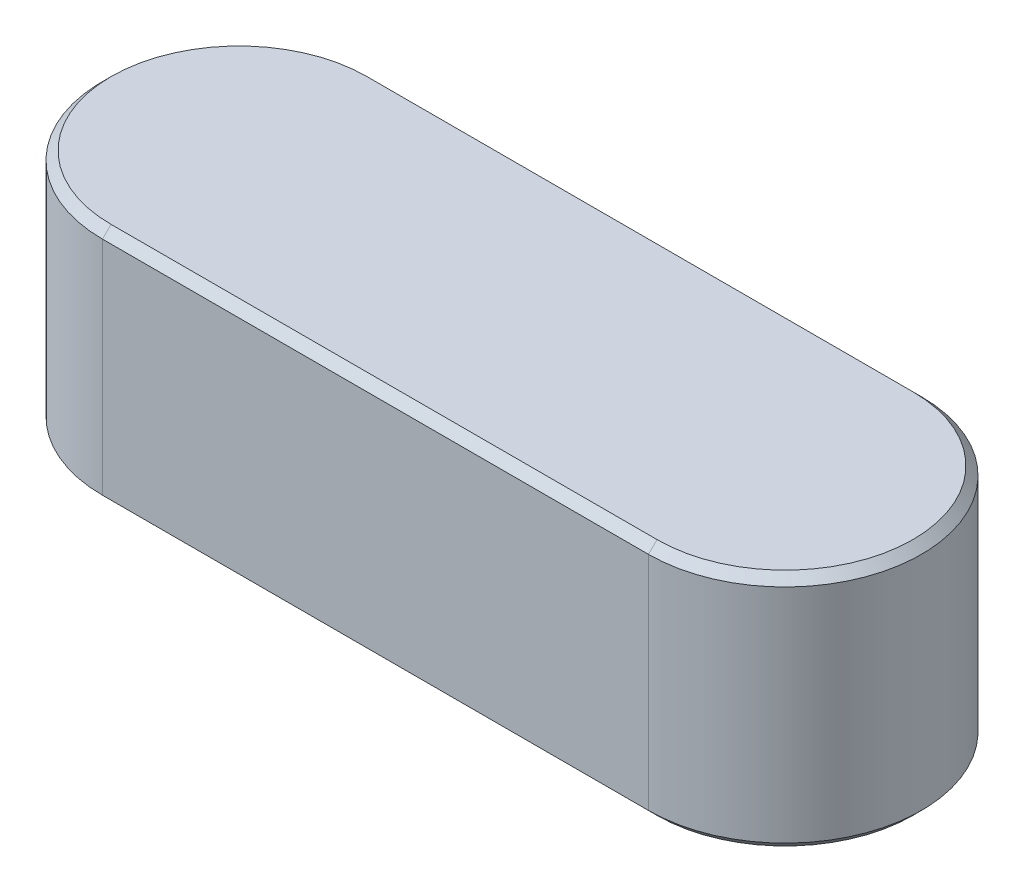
ISO-10303-21;
HEADER;
FILE_DESCRIPTION(('STEP AP214'),'2;1');
FILE_NAME('part.step','',(''),(''),'','','');
FILE_SCHEMA(('AUTOMOTIVE_DESIGN { 1 0 10303 214 1 1 1 1 }'));
ENDSEC;
DATA;
#1=APPLICATION_CONTEXT('core data for automotive mechanical design processes');
#2=APPLICATION_PROTOCOL_DEFINITION('international standard','automotive_design',2000,#1);
#3=PRODUCT_CONTEXT('',#1,'mechanical');
#4=PRODUCT('Part','Part','',(#3));
#5=PRODUCT_RELATED_PRODUCT_CATEGORY('part','',(#4));
#6=PRODUCT_DEFINITION_FORMATION('','',#4);
#7=PRODUCT_DEFINITION_CONTEXT('part definition',#1,'design');
#8=PRODUCT_DEFINITION('design','',#6,#7);
#9=PRODUCT_DEFINITION_SHAPE('','',#8);
#10=(LENGTH_UNIT() NAMED_UNIT(*) SI_UNIT(.MILLI.,.METRE.));
#11=(NAMED_UNIT(*) PLANE_ANGLE_UNIT() SI_UNIT($,.RADIAN.));
#12=(NAMED_UNIT(*) SI_UNIT($,.STERADIAN.) SOLID_ANGLE_UNIT());
#13=UNCERTAINTY_MEASURE_WITH_UNIT(LENGTH_MEASURE(1.E-05),#10,'distance_accuracy_value','');
#14=(GEOMETRIC_REPRESENTATION_CONTEXT(3) GLOBAL_UNCERTAINTY_ASSIGNED_CONTEXT((#13)) GLOBAL_UNIT_ASSIGNED_CONTEXT((#10,
#11,#12)) REPRESENTATION_CONTEXT('',''));
#15=CARTESIAN_POINT('',(0.,0.,0.));
#16=DIRECTION('',(0.,0.,1.));
#17=DIRECTION('',(1.,0.,0.));
#18=AXIS2_PLACEMENT_3D('',#15,#16,#17);
#19=CARTESIAN_POINT('',(0.,7.,0.));
#20=DIRECTION('',(0.,-1.,0.));
#21=DIRECTION('',(0.,0.,-1.));
#22=AXIS2_PLACEMENT_3D('',#19,#20,#21);
#23=CYLINDRICAL_SURFACE('',#22,4.);
#24=DIRECTION('',(0.,-1.,0.));
#25=VECTOR('',#24,1.);
#26=CARTESIAN_POINT('',(0.,7.,4.));
#27=LINE('',#26,#25);
#28=CARTESIAN_POINT('',(0.,6.75,4.));
#29=VERTEX_POINT('',#28);
#30=CARTESIAN_POINT('',(0.,0.250000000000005,4.));
#31=VERTEX_POINT('',#30);
#32=EDGE_CURVE('E98',#29,#31,#27,.T.);
#33=ORIENTED_EDGE('',*,*,#32,.F.);
#34=CARTESIAN_POINT('',(0.,6.75,0.));
#35=DIRECTION('',(0.,1.,0.));
#36=DIRECTION('',(0.,0.,1.));
#37=AXIS2_PLACEMENT_3D('',#34,#35,#36);
#38=CIRCLE('',#37,4.);
#39=CARTESIAN_POINT('',(0.,6.75,-4.));
#40=VERTEX_POINT('',#39);
#41=EDGE_CURVE('E95',#29,#40,#38,.F.);
#42=ORIENTED_EDGE('',*,*,#41,.T.);
#43=DIRECTION('',(0.,-1.,0.));
#44=VECTOR('',#43,1.);
#45=CARTESIAN_POINT('',(0.,7.,-4.));
#46=LINE('',#45,#44);
#47=CARTESIAN_POINT('',(0.,0.250000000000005,-4.));
#48=VERTEX_POINT('',#47);
#49=EDGE_CURVE('E97',#40,#48,#46,.T.);
#50=ORIENTED_EDGE('',*,*,#49,.T.);
#51=CARTESIAN_POINT('',(0.,0.250000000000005,0.));
#52=DIRECTION('',(0.,1.,0.));
#53=DIRECTION('',(0.,0.,1.));
#54=AXIS2_PLACEMENT_3D('',#51,#52,#53);
#55=CIRCLE('',#54,4.);
#56=EDGE_CURVE('E45',#48,#31,#55,.T.);
#57=ORIENTED_EDGE('',*,*,#56,.T.);
#58=EDGE_LOOP('',(#33,#42,#50,#57));
#59=FACE_BOUND('',#58,.T.);
#60=ADVANCED_FACE('F31',(#59),#23,.T.);
#61=CARTESIAN_POINT('',(16.,7.,4.));
#62=DIRECTION('',(0.,0.,-1.));
#63=DIRECTION('',(-1.,0.,0.));
#64=AXIS2_PLACEMENT_3D('',#61,#62,#63);
#65=PLANE('',#64);
#66=DIRECTION('',(0.,-1.,0.));
#67=VECTOR('',#66,1.);
#68=CARTESIAN_POINT('',(16.,7.,4.));
#69=LINE('',#68,#67);
#70=CARTESIAN_POINT('',(16.,6.75,4.));
#71=VERTEX_POINT('',#70);
#72=CARTESIAN_POINT('',(16.,0.250000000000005,4.));
#73=VERTEX_POINT('',#72);
#74=EDGE_CURVE('E142',#71,#73,#69,.T.);
#75=ORIENTED_EDGE('',*,*,#74,.F.);
#76=DIRECTION('',(-1.,0.,0.));
#77=VECTOR('',#76,1.);
#78=CARTESIAN_POINT('',(0.,6.75,4.));
#79=LINE('',#78,#77);
#80=EDGE_CURVE('E166',#71,#29,#79,.T.);
#81=ORIENTED_EDGE('',*,*,#80,.T.);
#82=ORIENTED_EDGE('',*,*,#32,.T.);
#83=DIRECTION('',(1.,0.,0.));
#84=VECTOR('',#83,1.);
#85=CARTESIAN_POINT('',(16.,0.250000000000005,4.));
#86=LINE('',#85,#84);
#87=EDGE_CURVE('E164',#31,#73,#86,.T.);
#88=ORIENTED_EDGE('',*,*,#87,.T.);
#89=EDGE_LOOP('',(#75,#81,#82,#88));
#90=FACE_BOUND('',#89,.T.);
#91=ADVANCED_FACE('F190',(#90),#65,.F.);
#92=CARTESIAN_POINT('',(16.,7.,0.));
#93=DIRECTION('',(0.,-1.,0.));
#94=DIRECTION('',(0.,0.,-1.));
#95=AXIS2_PLACEMENT_3D('',#92,#93,#94);
#96=CYLINDRICAL_SURFACE('',#95,4.);
#97=DIRECTION('',(0.,-1.,0.));
#98=VECTOR('',#97,1.);
#99=CARTESIAN_POINT('',(16.,7.,-4.));
#100=LINE('',#99,#98);
#101=CARTESIAN_POINT('',(16.,6.75,-4.));
#102=VERTEX_POINT('',#101);
#103=CARTESIAN_POINT('',(16.,0.250000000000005,-4.));
#104=VERTEX_POINT('',#103);
#105=EDGE_CURVE('E112',#102,#104,#100,.T.);
#106=ORIENTED_EDGE('',*,*,#105,.F.);
#107=CARTESIAN_POINT('',(16.,6.75,0.));
#108=DIRECTION('',(0.,1.,0.));
#109=DIRECTION('',(0.,0.,1.));
#110=AXIS2_PLACEMENT_3D('',#107,#108,#109);
#111=CIRCLE('',#110,4.);
#112=EDGE_CURVE('E11',#102,#71,#111,.F.);
#113=ORIENTED_EDGE('',*,*,#112,.T.);
#114=ORIENTED_EDGE('',*,*,#74,.T.);
#115=CARTESIAN_POINT('',(16.,0.250000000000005,0.));
#116=DIRECTION('',(0.,1.,0.));
#117=DIRECTION('',(0.,0.,1.));
#118=AXIS2_PLACEMENT_3D('',#115,#116,#117);
#119=CIRCLE('',#118,4.);
#120=EDGE_CURVE('E38',#73,#104,#119,.T.);
#121=ORIENTED_EDGE('',*,*,#120,.T.);
#122=EDGE_LOOP('',(#106,#113,#114,#121));
#123=FACE_BOUND('',#122,.T.);
#124=ADVANCED_FACE('F170',(#123),#96,.T.);
#125=CARTESIAN_POINT('',(16.,7.,-4.));
#126=DIRECTION('',(0.,0.,1.));
#127=DIRECTION('',(1.,0.,0.));
#128=AXIS2_PLACEMENT_3D('',#125,#126,#127);
#129=PLANE('',#128);
#130=ORIENTED_EDGE('',*,*,#105,.T.);
#131=DIRECTION('',(-1.,0.,0.));
#132=VECTOR('',#131,1.);
#133=CARTESIAN_POINT('',(16.,0.250000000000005,-4.));
#134=LINE('',#133,#132);
#135=EDGE_CURVE('E111',#104,#48,#134,.T.);
#136=ORIENTED_EDGE('',*,*,#135,.T.);
#137=ORIENTED_EDGE('',*,*,#49,.F.);
#138=DIRECTION('',(1.,0.,0.));
#139=VECTOR('',#138,1.);
#140=CARTESIAN_POINT('',(16.,6.75,-4.));
#141=LINE('',#140,#139);
#142=EDGE_CURVE('E108',#40,#102,#141,.T.);
#143=ORIENTED_EDGE('',*,*,#142,.T.);
#144=EDGE_LOOP('',(#130,#136,#137,#143));
#145=FACE_BOUND('',#144,.T.);
#146=ADVANCED_FACE('F107',(#145),#129,.F.);
#147=CARTESIAN_POINT('',(0.,7.,0.));
#148=DIRECTION('',(0.,1.,0.));
#149=DIRECTION('',(0.,0.,1.));
#150=AXIS2_PLACEMENT_3D('',#147,#148,#149);
#151=PLANE('',#150);
#152=CARTESIAN_POINT('',(0.,7.,0.));
#153=DIRECTION('',(0.,1.,0.));
#154=DIRECTION('',(0.,0.,1.));
#155=AXIS2_PLACEMENT_3D('',#152,#153,#154);
#156=CIRCLE('',#155,3.75);
#157=CARTESIAN_POINT('',(0.,7.,-3.74999999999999));
#158=VERTEX_POINT('',#157);
#159=CARTESIAN_POINT('',(0.,7.,3.75));
#160=VERTEX_POINT('',#159);
#161=EDGE_CURVE('E127',#158,#160,#156,.T.);
#162=ORIENTED_EDGE('',*,*,#161,.T.);
#163=DIRECTION('',(1.,0.,0.));
#164=VECTOR('',#163,1.);
#165=CARTESIAN_POINT('',(16.,7.,3.75));
#166=LINE('',#165,#164);
#167=CARTESIAN_POINT('',(16.,7.,3.75));
#168=VERTEX_POINT('',#167);
#169=EDGE_CURVE('E161',#160,#168,#166,.T.);
#170=ORIENTED_EDGE('',*,*,#169,.T.);
#171=CARTESIAN_POINT('',(16.,7.,0.));
#172=DIRECTION('',(0.,1.,0.));
#173=DIRECTION('',(0.,0.,1.));
#174=AXIS2_PLACEMENT_3D('',#171,#172,#173);
#175=CIRCLE('',#174,3.75);
#176=CARTESIAN_POINT('',(16.,7.,-3.75));
#177=VERTEX_POINT('',#176);
#178=EDGE_CURVE('E156',#168,#177,#175,.T.);
#179=ORIENTED_EDGE('',*,*,#178,.T.);
#180=DIRECTION('',(-1.,0.,0.));
#181=VECTOR('',#180,1.);
#182=CARTESIAN_POINT('',(0.,7.,-3.74999999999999));
#183=LINE('',#182,#181);
#184=EDGE_CURVE('E158',#177,#158,#183,.T.);
#185=ORIENTED_EDGE('',*,*,#184,.T.);
#186=EDGE_LOOP('',(#162,#170,#179,#185));
#187=FACE_BOUND('',#186,.T.);
#188=ADVANCED_FACE('F199',(#187),#151,.T.);
#189=CARTESIAN_POINT('',(0.,0.,0.));
#190=DIRECTION('',(0.,1.,0.));
#191=DIRECTION('',(0.,0.,1.));
#192=AXIS2_PLACEMENT_3D('',#189,#190,#191);
#193=PLANE('',#192);
#194=DIRECTION('',(-1.,0.,0.));
#195=VECTOR('',#194,1.);
#196=CARTESIAN_POINT('',(0.,0.,3.75));
#197=LINE('',#196,#195);
#198=CARTESIAN_POINT('',(16.,0.,3.75));
#199=VERTEX_POINT('',#198);
#200=CARTESIAN_POINT('',(0.,0.,3.75));
#201=VERTEX_POINT('',#200);
#202=EDGE_CURVE('E149',#199,#201,#197,.T.);
#203=ORIENTED_EDGE('',*,*,#202,.T.);
#204=CARTESIAN_POINT('',(0.,0.,0.));
#205=DIRECTION('',(0.,1.,0.));
#206=DIRECTION('',(0.,0.,1.));
#207=AXIS2_PLACEMENT_3D('',#204,#205,#206);
#208=CIRCLE('',#207,3.75);
#209=CARTESIAN_POINT('',(0.,0.,-3.75));
#210=VERTEX_POINT('',#209);
#211=EDGE_CURVE('E154',#201,#210,#208,.F.);
#212=ORIENTED_EDGE('',*,*,#211,.T.);
#213=DIRECTION('',(1.,0.,0.));
#214=VECTOR('',#213,1.);
#215=CARTESIAN_POINT('',(0.,0.,-3.75));
#216=LINE('',#215,#214);
#217=CARTESIAN_POINT('',(16.,0.,-3.75));
#218=VERTEX_POINT('',#217);
#219=EDGE_CURVE('E151',#210,#218,#216,.T.);
#220=ORIENTED_EDGE('',*,*,#219,.T.);
#221=CARTESIAN_POINT('',(16.,0.,0.));
#222=DIRECTION('',(0.,1.,0.));
#223=DIRECTION('',(0.,0.,1.));
#224=AXIS2_PLACEMENT_3D('',#221,#222,#223);
#225=CIRCLE('',#224,3.75);
#226=EDGE_CURVE('E147',#218,#199,#225,.F.);
#227=ORIENTED_EDGE('',*,*,#226,.T.);
#228=EDGE_LOOP('',(#203,#212,#220,#227));
#229=FACE_BOUND('',#228,.T.);
#230=ADVANCED_FACE('F201',(#229),#193,.F.);
#231=CARTESIAN_POINT('',(16.,0.250000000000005,4.));
#232=DIRECTION('',(0.,0.707106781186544,-0.707106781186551));
#233=DIRECTION('',(0.,0.707106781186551,0.707106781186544));
#234=AXIS2_PLACEMENT_3D('',#231,#232,#233);
#235=PLANE('',#234);
#236=DIRECTION('',(0.,0.707106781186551,0.707106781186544));
#237=VECTOR('',#236,1.);
#238=CARTESIAN_POINT('',(0.,0.,3.75));
#239=LINE('',#238,#237);
#240=EDGE_CURVE('E136',#201,#31,#239,.T.);
#241=ORIENTED_EDGE('',*,*,#240,.F.);
#242=ORIENTED_EDGE('',*,*,#202,.F.);
#243=DIRECTION('',(0.,-0.707106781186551,-0.707106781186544));
#244=VECTOR('',#243,1.);
#245=CARTESIAN_POINT('',(16.,0.250000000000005,4.));
#246=LINE('',#245,#244);
#247=EDGE_CURVE('E113',#73,#199,#246,.T.);
#248=ORIENTED_EDGE('',*,*,#247,.F.);
#249=ORIENTED_EDGE('',*,*,#87,.F.);
#250=EDGE_LOOP('',(#241,#242,#248,#249));
#251=FACE_BOUND('',#250,.T.);
#252=ADVANCED_FACE('F188',(#251),#235,.F.);
#253=CARTESIAN_POINT('',(16.,0.250000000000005,0.));
#254=DIRECTION('',(0.,1.,0.));
#255=DIRECTION('',(0.,0.,1.));
#256=AXIS2_PLACEMENT_3D('',#253,#254,#255);
#257=CONICAL_SURFACE('',#256,4.,0.785398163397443);
#258=ORIENTED_EDGE('',*,*,#247,.T.);
#259=ORIENTED_EDGE('',*,*,#226,.F.);
#260=DIRECTION('',(0.,-0.707106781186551,0.707106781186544));
#261=VECTOR('',#260,1.);
#262=CARTESIAN_POINT('',(16.,0.250000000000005,-4.));
#263=LINE('',#262,#261);
#264=EDGE_CURVE('E130',#104,#218,#263,.T.);
#265=ORIENTED_EDGE('',*,*,#264,.F.);
#266=ORIENTED_EDGE('',*,*,#120,.F.);
#267=EDGE_LOOP('',(#258,#259,#265,#266));
#268=FACE_BOUND('',#267,.T.);
#269=ADVANCED_FACE('F176',(#268),#257,.T.);
#270=CARTESIAN_POINT('',(0.,0.250000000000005,0.));
#271=DIRECTION('',(0.,1.,0.));
#272=DIRECTION('',(0.,0.,1.));
#273=AXIS2_PLACEMENT_3D('',#270,#271,#272);
#274=CONICAL_SURFACE('',#273,4.,0.785398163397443);
#275=ORIENTED_EDGE('',*,*,#240,.T.);
#276=ORIENTED_EDGE('',*,*,#56,.F.);
#277=DIRECTION('',(0.,0.707106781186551,-0.707106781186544));
#278=VECTOR('',#277,1.);
#279=CARTESIAN_POINT('',(0.,0.,-3.75));
#280=LINE('',#279,#278);
#281=EDGE_CURVE('E128',#210,#48,#280,.T.);
#282=ORIENTED_EDGE('',*,*,#281,.F.);
#283=ORIENTED_EDGE('',*,*,#211,.F.);
#284=EDGE_LOOP('',(#275,#276,#282,#283));
#285=FACE_BOUND('',#284,.T.);
#286=ADVANCED_FACE('F183',(#285),#274,.T.);
#287=CARTESIAN_POINT('',(16.,0.250000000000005,-4.));
#288=DIRECTION('',(0.,0.707106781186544,0.707106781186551));
#289=DIRECTION('',(0.,-0.707106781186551,0.707106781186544));
#290=AXIS2_PLACEMENT_3D('',#287,#288,#289);
#291=PLANE('',#290);
#292=ORIENTED_EDGE('',*,*,#264,.T.);
#293=ORIENTED_EDGE('',*,*,#219,.F.);
#294=ORIENTED_EDGE('',*,*,#281,.T.);
#295=ORIENTED_EDGE('',*,*,#135,.F.);
#296=EDGE_LOOP('',(#292,#293,#294,#295));
#297=FACE_BOUND('',#296,.T.);
#298=ADVANCED_FACE('F179',(#297),#291,.F.);
#299=CARTESIAN_POINT('',(0.,7.,-3.74999999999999));
#300=DIRECTION('',(0.,0.707106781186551,-0.707106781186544));
#301=DIRECTION('',(0.,0.707106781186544,0.707106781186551));
#302=AXIS2_PLACEMENT_3D('',#299,#300,#301);
#303=PLANE('',#302);
#304=DIRECTION('',(0.,0.707106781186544,0.707106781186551));
#305=VECTOR('',#304,1.);
#306=CARTESIAN_POINT('',(16.,6.75,-4.));
#307=LINE('',#306,#305);
#308=EDGE_CURVE('E123',#102,#177,#307,.T.);
#309=ORIENTED_EDGE('',*,*,#308,.F.);
#310=ORIENTED_EDGE('',*,*,#142,.F.);
#311=DIRECTION('',(0.,-0.707106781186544,-0.707106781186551));
#312=VECTOR('',#311,1.);
#313=CARTESIAN_POINT('',(0.,7.,-3.74999999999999));
#314=LINE('',#313,#312);
#315=EDGE_CURVE('E120',#158,#40,#314,.T.);
#316=ORIENTED_EDGE('',*,*,#315,.F.);
#317=ORIENTED_EDGE('',*,*,#184,.F.);
#318=EDGE_LOOP('',(#309,#310,#316,#317));
#319=FACE_BOUND('',#318,.T.);
#320=ADVANCED_FACE('F118',(#319),#303,.T.);
#321=CARTESIAN_POINT('',(0.,7.,0.));
#322=DIRECTION('',(0.,-1.,0.));
#323=DIRECTION('',(0.,0.,-1.));
#324=AXIS2_PLACEMENT_3D('',#321,#322,#323);
#325=CONICAL_SURFACE('',#324,3.75,0.785398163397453);
#326=ORIENTED_EDGE('',*,*,#315,.T.);
#327=ORIENTED_EDGE('',*,*,#41,.F.);
#328=DIRECTION('',(0.,-0.707106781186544,0.707106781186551));
#329=VECTOR('',#328,1.);
#330=CARTESIAN_POINT('',(0.,7.,3.75));
#331=LINE('',#330,#329);
#332=EDGE_CURVE('E53',#160,#29,#331,.T.);
#333=ORIENTED_EDGE('',*,*,#332,.F.);
#334=ORIENTED_EDGE('',*,*,#161,.F.);
#335=EDGE_LOOP('',(#326,#327,#333,#334));
#336=FACE_BOUND('',#335,.T.);
#337=ADVANCED_FACE('F126',(#336),#325,.T.);
#338=CARTESIAN_POINT('',(16.,7.,0.));
#339=DIRECTION('',(0.,-1.,0.));
#340=DIRECTION('',(0.,0.,-1.));
#341=AXIS2_PLACEMENT_3D('',#338,#339,#340);
#342=CONICAL_SURFACE('',#341,3.75,0.785398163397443);
#343=ORIENTED_EDGE('',*,*,#308,.T.);
#344=ORIENTED_EDGE('',*,*,#178,.F.);
#345=DIRECTION('',(0.,0.707106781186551,-0.707106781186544));
#346=VECTOR('',#345,1.);
#347=CARTESIAN_POINT('',(16.,6.75,4.));
#348=LINE('',#347,#346);
#349=EDGE_CURVE('E193',#71,#168,#348,.T.);
#350=ORIENTED_EDGE('',*,*,#349,.F.);
#351=ORIENTED_EDGE('',*,*,#112,.F.);
#352=EDGE_LOOP('',(#343,#344,#350,#351));
#353=FACE_BOUND('',#352,.T.);
#354=ADVANCED_FACE('F196',(#353),#342,.T.);
#355=CARTESIAN_POINT('',(0.,7.,3.75));
#356=DIRECTION('',(0.,0.707106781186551,0.707106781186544));
#357=DIRECTION('',(0.,-0.707106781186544,0.707106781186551));
#358=AXIS2_PLACEMENT_3D('',#355,#356,#357);
#359=PLANE('',#358);
#360=ORIENTED_EDGE('',*,*,#332,.T.);
#361=ORIENTED_EDGE('',*,*,#80,.F.);
#362=ORIENTED_EDGE('',*,*,#349,.T.);
#363=ORIENTED_EDGE('',*,*,#169,.F.);
#364=EDGE_LOOP('',(#360,#361,#362,#363));
#365=FACE_BOUND('',#364,.T.);
#366=ADVANCED_FACE('F192',(#365),#359,.T.);
#367=CLOSED_SHELL('',(#60,#91,#124,#146,#188,#230,#252,#269,#286,#298,#320,#337,#354,#366));
#368=MANIFOLD_SOLID_BREP('B2',#367);
#369=ADVANCED_BREP_SHAPE_REPRESENTATION('',(#18,#368),#14);
#370=SHAPE_DEFINITION_REPRESENTATION(#9,#369);
ENDSEC;
END-ISO-10303-21;
